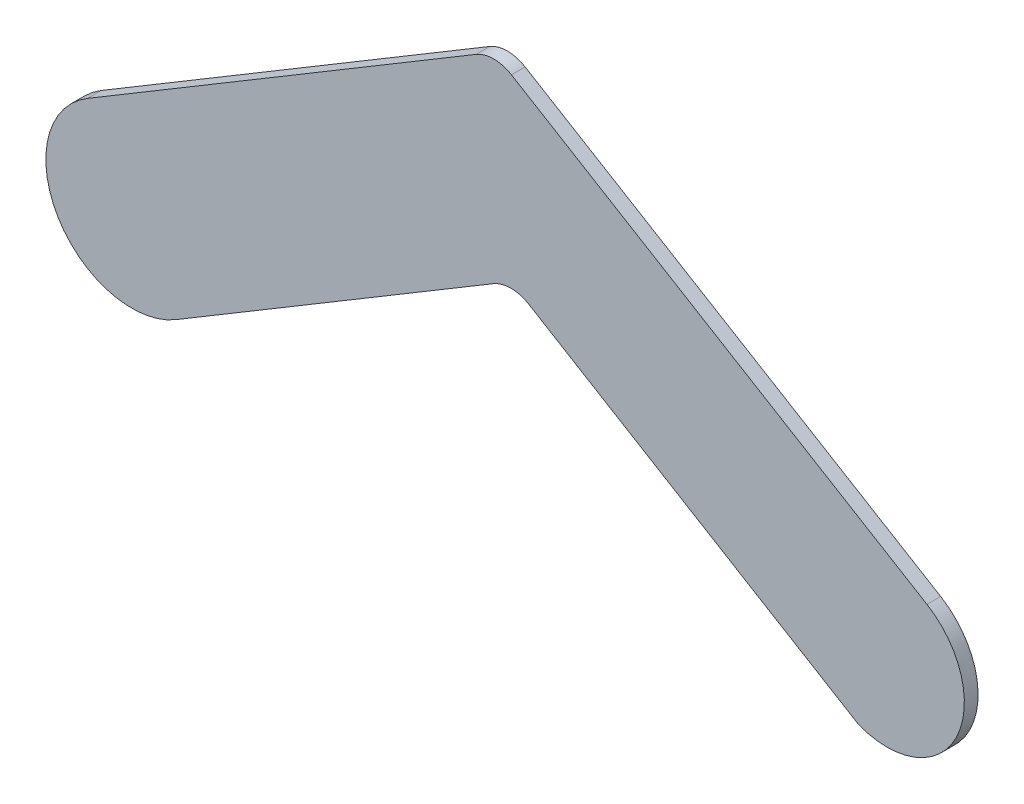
from build123d import *

# Parameters (mm, degrees)
AUFSATZ_LINEAR_AUSTRAGEN1_DEPTH = 4
SKALIEREN1_SCALE                = 1.19


with BuildPart() as part:
    # Skizze4 → Aufsatz-Linear austragen1 (new body)
    with BuildSketch(Plane.XY):
        with BuildLine():
            Line((-90.497367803, 4.18891616), (2.15003604, 59.603289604))
            ThreePointArc((2.15003604, 59.603289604), (7.303284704, 61.021234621), (12.450776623, 59.582531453))
            Line((12.450776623, 59.582531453), (108.761845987, 1.448523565))
            ThreePointArc((108.761845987, 1.448523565), (137.304901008, 12.456290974), (128.725813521, 41.820830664))
            Line((128.725813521, 41.820830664), (7.416269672, 115.044085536))
            ThreePointArc((7.416269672, 115.044085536), (2.268777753, 116.482788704), (-2.884470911, 115.064843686))
            Line((-2.884470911, 115.064843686), (-116.256046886, 47.254904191))
            Line((-116.256046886, 47.254904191), (-116.322430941, 47.215198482))
            ThreePointArc((-116.322430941, 47.215198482), (-124.923040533, 12.789525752), (-90.497367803, 4.18891616))
        make_face()
    extrude(amount=-AUFSATZ_LINEAR_AUSTRAGEN1_DEPTH)


with BuildPart() as part_1:
    # Skalieren1: scaled about (2.550538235, 53.165241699, -2)
    add(part.part.scale(SKALIEREN1_SCALE).moved(Location((-0.484602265, -10.101395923, 0.38))))


solid = part_1.part
